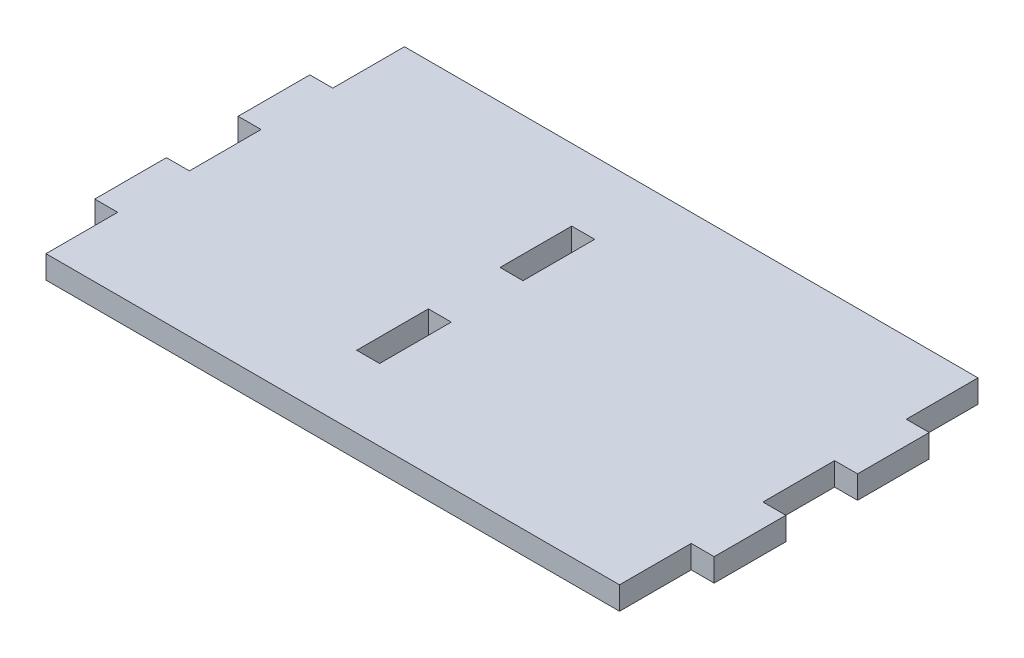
from build123d import *

# Parameters (mm, degrees)
CROQUIS1_W              = 12
CROQUIS1_H              = 37.5
SALIENTE_EXTRUIR1_DEPTH = 12


with BuildPart() as part:
    # Croquis1 → Saliente-Extruir1 (new body)
    with BuildSketch(Plane(origin=(0, 0, 0), x_dir=(1, 0, 0), z_dir=(0, 1, 0))):
        Polygon((-162, 18.75), (-162, 56.25), (-150, 56.25), (-150, 93.75), (150, 93.75), (150, 56.25), (162, 56.25), (162, 18.75), (150, 18.75), (150, -18.75), (162, -18.75), (162, -56.25), (150, -56.25), (150, -93.75), (-150, -93.75), (-150, -56.25), (-162, -56.25), (-162, -18.75), (-150, -18.75), (-150, 18.75), align=None)
        with Locations((-19, -37.5)):
            Rectangle(CROQUIS1_W, CROQUIS1_H, mode=Mode.SUBTRACT)
        with Locations((-19, 37.5)):
            Rectangle(CROQUIS1_W, CROQUIS1_H, mode=Mode.SUBTRACT)
    extrude(amount=SALIENTE_EXTRUIR1_DEPTH)


solid = part.part
